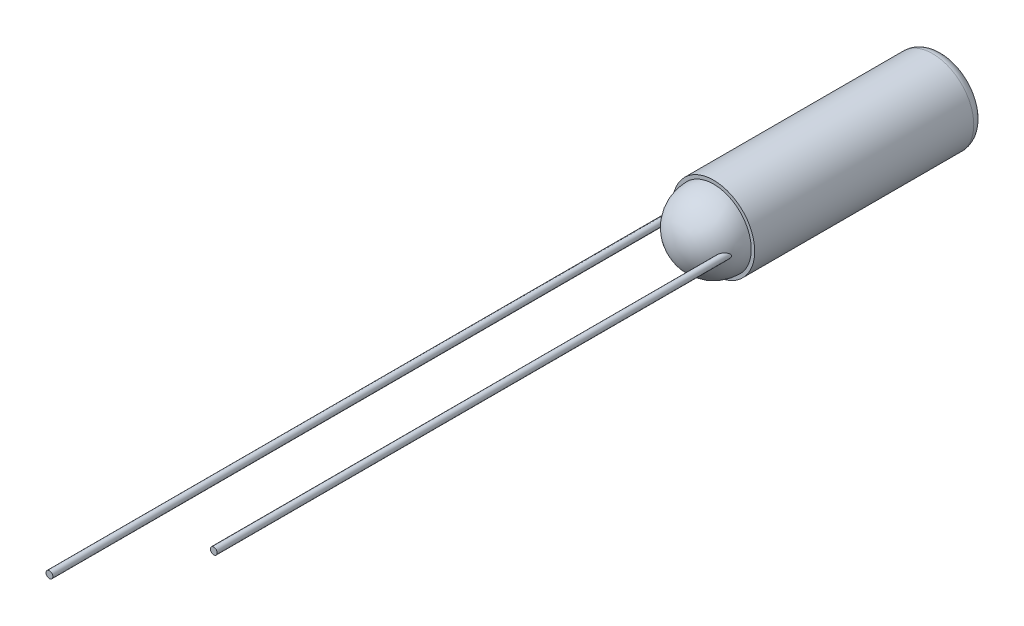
ISO-10303-21;
HEADER;
FILE_DESCRIPTION(('STEP AP214'),'2;1');
FILE_NAME('part.step','',(''),(''),'','','');
FILE_SCHEMA(('AUTOMOTIVE_DESIGN { 1 0 10303 214 1 1 1 1 }'));
ENDSEC;
DATA;
#1=APPLICATION_CONTEXT('core data for automotive mechanical design processes');
#2=APPLICATION_PROTOCOL_DEFINITION('international standard','automotive_design',2000,#1);
#3=PRODUCT_CONTEXT('',#1,'mechanical');
#4=PRODUCT('Part','Part','',(#3));
#5=PRODUCT_RELATED_PRODUCT_CATEGORY('part','',(#4));
#6=PRODUCT_DEFINITION_FORMATION('','',#4);
#7=PRODUCT_DEFINITION_CONTEXT('part definition',#1,'design');
#8=PRODUCT_DEFINITION('design','',#6,#7);
#9=PRODUCT_DEFINITION_SHAPE('','',#8);
#10=(LENGTH_UNIT() NAMED_UNIT(*) SI_UNIT(.MILLI.,.METRE.));
#11=(NAMED_UNIT(*) PLANE_ANGLE_UNIT() SI_UNIT($,.RADIAN.));
#12=(NAMED_UNIT(*) SI_UNIT($,.STERADIAN.) SOLID_ANGLE_UNIT());
#13=UNCERTAINTY_MEASURE_WITH_UNIT(LENGTH_MEASURE(1.E-05),#10,'distance_accuracy_value','');
#14=(GEOMETRIC_REPRESENTATION_CONTEXT(3) GLOBAL_UNCERTAINTY_ASSIGNED_CONTEXT((#13)) GLOBAL_UNIT_ASSIGNED_CONTEXT((#10,
#11,#12)) REPRESENTATION_CONTEXT('',''));
#15=CARTESIAN_POINT('',(0.,0.,0.));
#16=DIRECTION('',(0.,0.,1.));
#17=DIRECTION('',(1.,0.,0.));
#18=AXIS2_PLACEMENT_3D('',#15,#16,#17);
#19=CARTESIAN_POINT('',(-24.8104901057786,21.2733851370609,3.92921669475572));
#20=DIRECTION('',(0.,0.,-1.));
#21=DIRECTION('',(-1.,0.,0.));
#22=AXIS2_PLACEMENT_3D('',#19,#20,#21);
#23=PLANE('',#22);
#24=CARTESIAN_POINT('',(-24.8104901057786,19.7493851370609,3.9292166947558));
#25=DIRECTION('',(0.,0.,-1.));
#26=DIRECTION('',(-1.,0.,0.));
#27=AXIS2_PLACEMENT_3D('',#24,#25,#26);
#28=CIRCLE('',#27,1.396990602);
#29=CARTESIAN_POINT('',(-26.2074807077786,19.7493851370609,3.92921669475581));
#30=VERTEX_POINT('',#29);
#31=EDGE_CURVE('E69',#30,#30,#28,.T.);
#32=ORIENTED_EDGE('',*,*,#31,.T.);
#33=EDGE_LOOP('',(#32));
#34=FACE_BOUND('',#33,.T.);
#35=CARTESIAN_POINT('',(-24.8104901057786,19.7493851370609,3.92921669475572));
#36=DIRECTION('',(0.,0.,1.));
#37=DIRECTION('',(1.,0.,0.));
#38=AXIS2_PLACEMENT_3D('',#35,#36,#37);
#39=CIRCLE('',#38,1.524);
#40=CARTESIAN_POINT('',(-23.2864901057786,19.7493851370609,3.92921669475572));
#41=VERTEX_POINT('',#40);
#42=EDGE_CURVE('E58',#41,#41,#39,.T.);
#43=ORIENTED_EDGE('',*,*,#42,.T.);
#44=EDGE_LOOP('',(#43));
#45=FACE_BOUND('',#44,.T.);
#46=ADVANCED_FACE('F16',(#34,#45),#23,.F.);
#47=CARTESIAN_POINT('',(-24.8104901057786,19.7493851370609,6.75193867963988));
#48=DIRECTION('',(0.,0.,1.));
#49=DIRECTION('',(1.,0.,0.));
#50=AXIS2_PLACEMENT_3D('',#47,#48,#49);
#51=CYLINDRICAL_SURFACE('',#50,1.524);
#52=ORIENTED_EDGE('',*,*,#42,.F.);
#53=EDGE_LOOP('',(#52));
#54=FACE_BOUND('',#53,.T.);
#55=CARTESIAN_POINT('',(-24.8104901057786,19.7493851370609,-4.19878330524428));
#56=DIRECTION('',(0.,0.,1.));
#57=DIRECTION('',(1.,0.,0.));
#58=AXIS2_PLACEMENT_3D('',#55,#56,#57);
#59=CIRCLE('',#58,1.524);
#60=CARTESIAN_POINT('',(-23.2864901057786,19.7493851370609,-4.19878330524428));
#61=VERTEX_POINT('',#60);
#62=EDGE_CURVE('E52',#61,#61,#59,.T.);
#63=ORIENTED_EDGE('',*,*,#62,.T.);
#64=EDGE_LOOP('',(#63));
#65=FACE_BOUND('',#64,.T.);
#66=ADVANCED_FACE('F87',(#54,#65),#51,.T.);
#67=CARTESIAN_POINT('',(-24.8104901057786,19.7493851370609,-4.19878330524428));
#68=DIRECTION('',(0.,0.,1.));
#69=DIRECTION('',(1.,0.,0.));
#70=AXIS2_PLACEMENT_3D('',#67,#68,#69);
#71=TOROIDAL_SURFACE('',#70,1.143,0.381000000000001);
#72=ORIENTED_EDGE('',*,*,#62,.F.);
#73=EDGE_LOOP('',(#72));
#74=FACE_BOUND('',#73,.T.);
#75=CARTESIAN_POINT('',(-24.8104901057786,19.7493851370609,-4.57978330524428));
#76=DIRECTION('',(0.,0.,1.));
#77=DIRECTION('',(1.,0.,0.));
#78=AXIS2_PLACEMENT_3D('',#75,#76,#77);
#79=CIRCLE('',#78,1.14300000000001);
#80=CARTESIAN_POINT('',(-23.6674901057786,19.7493851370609,-4.57978330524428));
#81=VERTEX_POINT('',#80);
#82=EDGE_CURVE('E47',#81,#81,#79,.T.);
#83=ORIENTED_EDGE('',*,*,#82,.T.);
#84=EDGE_LOOP('',(#83));
#85=FACE_BOUND('',#84,.T.);
#86=ADVANCED_FACE('F83',(#74,#85),#71,.T.);
#87=CARTESIAN_POINT('',(-24.8104901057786,20.8923851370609,-4.57978330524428));
#88=DIRECTION('',(0.,0.,1.));
#89=DIRECTION('',(1.,0.,0.));
#90=AXIS2_PLACEMENT_3D('',#87,#88,#89);
#91=PLANE('',#90);
#92=ORIENTED_EDGE('',*,*,#82,.F.);
#93=EDGE_LOOP('',(#92));
#94=FACE_BOUND('',#93,.T.);
#95=ADVANCED_FACE('F80',(#94),#91,.F.);
#96=CARTESIAN_POINT('',(-24.8104901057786,19.7493851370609,3.9292166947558));
#97=DIRECTION('',(0.,0.,-1.));
#98=DIRECTION('',(-1.,0.,0.));
#99=AXIS2_PLACEMENT_3D('',#96,#97,#98);
#100=SPHERICAL_SURFACE('',#99,1.396990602);
#101=CARTESIAN_POINT('',(-26.0704996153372,19.705387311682,4.53090014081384));
#102=CARTESIAN_POINT('',(-26.0655741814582,19.6969257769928,4.54059567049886));
#103=CARTESIAN_POINT('',(-26.060089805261,19.6897045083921,4.55107731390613));
#104=CARTESIAN_POINT('',(-26.0484034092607,19.6770024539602,4.57272927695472));
#105=CARTESIAN_POINT('',(-26.0421962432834,19.6715353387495,4.58390423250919));
#106=CARTESIAN_POINT('',(-26.0252237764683,19.6591197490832,4.61358611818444));
#107=CARTESIAN_POINT('',(-26.0140189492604,19.6533552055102,4.63234221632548));
#108=CARTESIAN_POINT('',(-25.99058893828,19.64525543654,4.66990078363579));
#109=CARTESIAN_POINT('',(-25.9783650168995,19.6429160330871,4.68870316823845));
#110=CARTESIAN_POINT('',(-25.9559938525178,19.6420327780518,4.72179824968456));
#111=CARTESIAN_POINT('',(-25.9459871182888,19.6427623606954,4.7361664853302));
#112=CARTESIAN_POINT('',(-25.9257721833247,19.646801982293,4.76438667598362));
#113=CARTESIAN_POINT('',(-25.9155645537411,19.6501055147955,4.77823984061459));
#114=CARTESIAN_POINT('',(-25.8995567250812,19.6578509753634,4.79941366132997));
#115=CARTESIAN_POINT('',(-25.8936841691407,19.6612527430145,4.80706101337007));
#116=CARTESIAN_POINT('',(-25.8821608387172,19.6693210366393,4.82185214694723));
#117=CARTESIAN_POINT('',(-25.8765098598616,19.6739863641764,4.82899639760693));
#118=CARTESIAN_POINT('',(-25.8670767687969,19.6833922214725,4.84075920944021));
#119=CARTESIAN_POINT('',(-25.8631883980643,19.6878033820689,4.84555411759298));
#120=CARTESIAN_POINT('',(-25.8558344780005,19.6975184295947,4.85452999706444));
#121=CARTESIAN_POINT('',(-25.8523681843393,19.7028207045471,4.85871205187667));
#122=CARTESIAN_POINT('',(-25.8469375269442,19.7127944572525,4.86519270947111));
#123=CARTESIAN_POINT('',(-25.844820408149,19.7172492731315,4.86769489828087));
#124=CARTESIAN_POINT('',(-25.8410493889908,19.7266286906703,4.87210735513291));
#125=CARTESIAN_POINT('',(-25.8393952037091,19.73155300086,4.87401798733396));
#126=CARTESIAN_POINT('',(-25.8366595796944,19.7418375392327,4.87712651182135));
#127=CARTESIAN_POINT('',(-25.8355841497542,19.747201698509,4.87831694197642));
#128=CARTESIAN_POINT('',(-25.8341384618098,19.7581424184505,4.87983809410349));
#129=CARTESIAN_POINT('',(-25.8337674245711,19.7637187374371,4.88016976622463));
#130=CARTESIAN_POINT('',(-25.8337637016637,19.7740061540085,4.87995853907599));
#131=CARTESIAN_POINT('',(-25.8340278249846,19.778720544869,4.87954033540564));
#132=CARTESIAN_POINT('',(-25.8350596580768,19.7879975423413,4.87809569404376));
#133=CARTESIAN_POINT('',(-25.8358274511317,19.7925601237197,4.87706915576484));
#134=CARTESIAN_POINT('',(-25.837803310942,19.8014115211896,4.87448160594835));
#135=CARTESIAN_POINT('',(-25.8390100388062,19.8057011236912,4.87292222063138));
#136=CARTESIAN_POINT('',(-25.8417892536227,19.8139596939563,4.86935346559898));
#137=CARTESIAN_POINT('',(-25.8433618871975,19.8179285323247,4.86734391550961));
#138=CARTESIAN_POINT('',(-25.8477919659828,19.8277080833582,4.8616908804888));
#139=CARTESIAN_POINT('',(-25.8508675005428,19.8332619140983,4.85777322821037));
#140=CARTESIAN_POINT('',(-25.8575093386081,19.843513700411,4.84928678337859));
#141=CARTESIAN_POINT('',(-25.861076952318,19.8482092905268,4.84471625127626));
#142=CARTESIAN_POINT('',(-25.8704954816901,19.8590752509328,4.83258173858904));
#143=CARTESIAN_POINT('',(-25.8765580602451,19.8647168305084,4.82471057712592));
#144=CARTESIAN_POINT('',(-25.8890357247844,19.8744218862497,4.80831758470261));
#145=CARTESIAN_POINT('',(-25.8954514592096,19.8784823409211,4.79979454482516));
#146=CARTESIAN_POINT('',(-25.9121932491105,19.887235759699,4.77724630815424));
#147=CARTESIAN_POINT('',(-25.9226212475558,19.8909206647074,4.76290668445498));
#148=CARTESIAN_POINT('',(-25.9433372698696,19.8955657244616,4.73370338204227));
#149=CARTESIAN_POINT('',(-25.9536249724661,19.8965204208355,4.71883871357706));
#150=CARTESIAN_POINT('',(-25.9743250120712,19.8960392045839,4.68811335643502));
#151=CARTESIAN_POINT('',(-25.9847163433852,19.8944772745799,4.67224087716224));
#152=CARTESIAN_POINT('',(-26.004847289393,19.8888822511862,4.64054890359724));
#153=CARTESIAN_POINT('',(-26.0145880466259,19.8848536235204,4.62472936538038));
#154=CARTESIAN_POINT('',(-26.0295815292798,19.8762585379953,4.59961605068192));
#155=CARTESIAN_POINT('',(-26.0350982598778,19.8725202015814,4.59019226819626));
#156=CARTESIAN_POINT('',(-26.0457663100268,19.8639299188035,4.57162448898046));
#157=CARTESIAN_POINT('',(-26.0509174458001,19.8590774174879,4.56248063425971));
#158=CARTESIAN_POINT('',(-26.0595105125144,19.8493781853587,4.54696074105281));
#159=CARTESIAN_POINT('',(-26.0630598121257,19.8448276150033,4.54046003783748));
#160=CARTESIAN_POINT('',(-26.0697732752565,19.8347641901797,4.52802693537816));
#161=CARTESIAN_POINT('',(-26.0729386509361,19.8292545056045,4.52209276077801));
#162=CARTESIAN_POINT('',(-26.0772610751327,19.8200102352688,4.51394367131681));
#163=CARTESIAN_POINT('',(-26.0786412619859,19.8167318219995,4.51133290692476));
#164=CARTESIAN_POINT('',(-26.0811924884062,19.8098157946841,4.50650836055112));
#165=CARTESIAN_POINT('',(-26.0823637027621,19.8061784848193,4.50429424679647));
#166=CARTESIAN_POINT('',(-26.084247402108,19.7991858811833,4.50075702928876));
#167=CARTESIAN_POINT('',(-26.0850040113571,19.7958875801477,4.49934646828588));
#168=CARTESIAN_POINT('',(-26.0862676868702,19.7890720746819,4.49703054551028));
#169=CARTESIAN_POINT('',(-26.0867750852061,19.7855551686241,4.49612451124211));
#170=CARTESIAN_POINT('',(-26.087495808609,19.778352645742,4.49491417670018));
#171=CARTESIAN_POINT('',(-26.08770641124,19.7746657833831,4.49461543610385));
#172=CARTESIAN_POINT('',(-26.0878027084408,19.7672938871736,4.49467944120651));
#173=CARTESIAN_POINT('',(-26.0876884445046,19.7636088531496,4.495042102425));
#174=CARTESIAN_POINT('',(-26.0871924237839,19.7568662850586,4.49628649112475));
#175=CARTESIAN_POINT('',(-26.0868487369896,19.7537910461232,4.49709179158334));
#176=CARTESIAN_POINT('',(-26.0859653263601,19.7477988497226,4.49908805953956));
#177=CARTESIAN_POINT('',(-26.0854254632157,19.7448820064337,4.50027930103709));
#178=CARTESIAN_POINT('',(-26.0837813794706,19.7374011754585,4.50384358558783));
#179=CARTESIAN_POINT('',(-26.0825381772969,19.7329951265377,4.50648214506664));
#180=CARTESIAN_POINT('',(-26.0797423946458,19.7246787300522,4.5123109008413));
#181=CARTESIAN_POINT('',(-26.0781890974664,19.720769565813,4.51550237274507));
#182=CARTESIAN_POINT('',(-26.0746454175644,19.712919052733,4.52268081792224));
#183=CARTESIAN_POINT('',(-26.0726245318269,19.7090377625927,4.52671732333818));
#184=CARTESIAN_POINT('',(-26.0704996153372,19.705387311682,4.53090014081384));
#185=B_SPLINE_CURVE_WITH_KNOTS('',3,(#101,#102,#103,#104,#105,#106,#107,#108,#109,#110,#111,
#112,#113,#114,#115,#116,#117,#118,#119,#120,#121,#122,#123,#124,#125,#126,#127,#128,#129,#130,
#131,#132,#133,#134,#135,#136,#137,#138,#139,#140,#141,#142,#143,#144,#145,#146,#147,#148,#149,
#150,#151,#152,#153,#154,#155,#156,#157,#158,#159,#160,#161,#162,#163,#164,#165,#166,#167,#168,
#169,#170,#171,#172,#173,#174,#175,#176,#177,#178,#179,#180,#181,#182,#183,#184),.UNSPECIFIED.,
.T.,.F.,(4,2,2,2,2,2,2,2,2,2,2,2,2,2,2,2,2,2,2,2,2,2,2,2,2,2,2,2,2,2,2,2,2,2,2,2,2,2,2,2,2,4),
(0.,0.0413100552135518,0.0829346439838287,0.150372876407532,0.217728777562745,0.270150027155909,
0.32243919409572,0.353044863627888,0.383621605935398,0.406316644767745,0.428971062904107,
0.445504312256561,0.462027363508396,0.478718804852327,0.495391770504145,0.509542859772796,
0.523696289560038,0.537806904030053,0.551923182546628,0.574175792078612,0.596488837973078,
0.630573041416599,0.664722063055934,0.718752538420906,0.772890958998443,0.829825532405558,
0.886657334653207,0.921238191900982,0.955836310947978,0.981866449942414,1.0078121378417,
1.02102230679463,1.03422137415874,1.04517912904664,1.05612224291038,1.06716509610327,
1.07820653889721,1.08776197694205,1.09732421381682,1.11308499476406,1.12888263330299,
1.14670449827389),.UNSPECIFIED.);
#186=CARTESIAN_POINT('',(-26.0704996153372,19.705387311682,4.53090014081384));
#187=VERTEX_POINT('',#186);
#188=EDGE_CURVE('E20',#187,#187,#185,.T.);
#189=ORIENTED_EDGE('',*,*,#188,.F.);
#190=EDGE_LOOP('',(#189));
#191=FACE_BOUND('',#190,.T.);
#192=CARTESIAN_POINT('',(-23.5556650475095,19.7252789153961,4.54274396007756));
#193=CARTESIAN_POINT('',(-23.5587826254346,19.7168443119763,4.54878869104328));
#194=CARTESIAN_POINT('',(-23.5625380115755,19.7093954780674,4.55588717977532));
#195=CARTESIAN_POINT('',(-23.5707788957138,19.6960107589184,4.57106718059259));
#196=CARTESIAN_POINT('',(-23.5752721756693,19.6900929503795,4.57915890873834));
#197=CARTESIAN_POINT('',(-23.5873800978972,19.6765179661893,4.6004575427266));
#198=CARTESIAN_POINT('',(-23.5953433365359,19.6697175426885,4.61401150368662));
#199=CARTESIAN_POINT('',(-23.6120491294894,19.6584422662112,4.64149641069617));
#200=CARTESIAN_POINT('',(-23.620789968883,19.6539624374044,4.65542648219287));
#201=CARTESIAN_POINT('',(-23.6397121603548,19.6468039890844,4.68465156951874));
#202=CARTESIAN_POINT('',(-23.6499524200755,19.6443225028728,4.69995714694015));
#203=CARTESIAN_POINT('',(-23.6709805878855,19.6419370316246,4.73040277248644));
#204=CARTESIAN_POINT('',(-23.6817683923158,19.6420325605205,4.74554285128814));
#205=CARTESIAN_POINT('',(-23.7009078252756,19.6447596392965,4.77162872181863));
#206=CARTESIAN_POINT('',(-23.7092005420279,19.6467567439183,4.78268398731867));
#207=CARTESIAN_POINT('',(-23.7257568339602,19.6526665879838,4.80430253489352));
#208=CARTESIAN_POINT('',(-23.7340204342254,19.6565764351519,4.81486653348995));
#209=CARTESIAN_POINT('',(-23.7475592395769,19.6650413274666,4.8318435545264));
#210=CARTESIAN_POINT('',(-23.752931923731,19.668972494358,4.83848878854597));
#211=CARTESIAN_POINT('',(-23.7633453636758,19.6780322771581,4.851207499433));
#212=CARTESIAN_POINT('',(-23.768386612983,19.6831590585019,4.85728183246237));
#213=CARTESIAN_POINT('',(-23.77648634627,19.6930714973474,4.86692244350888));
#214=CARTESIAN_POINT('',(-23.7796951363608,19.6975228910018,4.87070442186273));
#215=CARTESIAN_POINT('',(-23.7856640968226,19.7071385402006,4.8776752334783));
#216=CARTESIAN_POINT('',(-23.788424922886,19.7123017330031,4.88086493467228));
#217=CARTESIAN_POINT('',(-23.7927939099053,19.7221477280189,4.88585807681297));
#218=CARTESIAN_POINT('',(-23.7945223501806,19.7267000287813,4.88781205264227));
#219=CARTESIAN_POINT('',(-23.7974823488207,19.7361731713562,4.89111625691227));
#220=CARTESIAN_POINT('',(-23.7987142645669,19.7410937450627,4.89246691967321));
#221=CARTESIAN_POINT('',(-23.8005943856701,19.7512235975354,4.89447196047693));
#222=CARTESIAN_POINT('',(-23.8012384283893,19.7564346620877,4.89512137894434));
#223=CARTESIAN_POINT('',(-23.8018705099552,19.7669347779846,4.89564774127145));
#224=CARTESIAN_POINT('',(-23.8018588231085,19.7722237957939,4.89552500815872));
#225=CARTESIAN_POINT('',(-23.8012252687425,19.7821045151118,4.89457601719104));
#226=CARTESIAN_POINT('',(-23.8006709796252,19.7867086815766,4.89382901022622));
#227=CARTESIAN_POINT('',(-23.7990963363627,19.7957094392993,4.89178689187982));
#228=CARTESIAN_POINT('',(-23.7980758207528,19.8001059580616,4.89049159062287));
#229=CARTESIAN_POINT('',(-23.7952655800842,19.8098960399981,4.88696272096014));
#230=CARTESIAN_POINT('',(-23.7933366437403,19.8151898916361,4.88456394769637));
#231=CARTESIAN_POINT('',(-23.7889584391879,19.8252063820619,4.87913477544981));
#232=CARTESIAN_POINT('',(-23.7865082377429,19.8299279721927,4.8761032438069));
#233=CARTESIAN_POINT('',(-23.7801234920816,19.840637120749,4.86819234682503));
#234=CARTESIAN_POINT('',(-23.7759965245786,19.8463292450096,4.86307017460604));
#235=CARTESIAN_POINT('',(-23.7672713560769,19.8566171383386,4.85217622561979));
#236=CARTESIAN_POINT('',(-23.7626722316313,19.8612106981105,4.84640317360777));
#237=CARTESIAN_POINT('',(-23.7505946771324,19.8716736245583,4.83112025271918));
#238=CARTESIAN_POINT('',(-23.7429213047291,19.8768595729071,4.82129841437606));
#239=CARTESIAN_POINT('',(-23.727337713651,19.8852751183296,4.80104214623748));
#240=CARTESIAN_POINT('',(-23.719427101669,19.8885012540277,4.79060666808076));
#241=CARTESIAN_POINT('',(-23.6997326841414,19.8944534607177,4.76417564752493));
#242=CARTESIAN_POINT('',(-23.6879448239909,19.8961651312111,4.74795458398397));
#243=CARTESIAN_POINT('',(-23.6647818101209,19.896455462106,4.71516216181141));
#244=CARTESIAN_POINT('',(-23.6534078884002,19.8950254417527,4.69858995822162));
#245=CARTESIAN_POINT('',(-23.6310594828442,19.8891304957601,4.66503249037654));
#246=CARTESIAN_POINT('',(-23.6201053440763,19.8845810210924,4.64804877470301));
#247=CARTESIAN_POINT('',(-23.5992332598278,19.8721330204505,4.61463302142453));
#248=CARTESIAN_POINT('',(-23.5893125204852,19.8642438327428,4.59819958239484));
#249=CARTESIAN_POINT('',(-23.5761079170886,19.8495037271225,4.57570570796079));
#250=CARTESIAN_POINT('',(-23.5721551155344,19.8444328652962,4.56887574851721));
#251=CARTESIAN_POINT('',(-23.564762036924,19.8331154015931,4.5559699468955));
#252=CARTESIAN_POINT('',(-23.5613186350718,19.8268765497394,4.54988954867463));
#253=CARTESIAN_POINT('',(-23.5569416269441,19.8167907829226,4.54213817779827));
#254=CARTESIAN_POINT('',(-23.5556747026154,19.8135344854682,4.53989104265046));
#255=CARTESIAN_POINT('',(-23.553357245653,19.8067036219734,4.53579024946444));
#256=CARTESIAN_POINT('',(-23.5523067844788,19.8031289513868,4.53393672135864));
#257=CARTESIAN_POINT('',(-23.5504782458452,19.7956275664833,4.53074156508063));
#258=CARTESIAN_POINT('',(-23.5497038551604,19.7916969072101,4.52940684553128));
#259=CARTESIAN_POINT('',(-23.5485253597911,19.7836122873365,4.52744223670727));
#260=CARTESIAN_POINT('',(-23.5481203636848,19.7794588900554,4.52681064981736));
#261=CARTESIAN_POINT('',(-23.5477505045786,19.7715828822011,4.5263702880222));
#262=CARTESIAN_POINT('',(-23.5477393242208,19.7678673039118,4.52647317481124));
#263=CARTESIAN_POINT('',(-23.5480363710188,19.7605132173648,4.52728291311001));
#264=CARTESIAN_POINT('',(-23.5483450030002,19.7568748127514,4.52799052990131));
#265=CARTESIAN_POINT('',(-23.5493165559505,19.7492189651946,4.53008474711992));
#266=CARTESIAN_POINT('',(-23.5500279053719,19.7452329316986,4.53156123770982));
#267=CARTESIAN_POINT('',(-23.5517513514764,19.7375813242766,4.53505381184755));
#268=CARTESIAN_POINT('',(-23.5527635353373,19.7339158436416,4.53707005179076));
#269=CARTESIAN_POINT('',(-23.5541717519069,19.7295396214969,4.53983461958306));
#270=CARTESIAN_POINT('',(-23.554461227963,19.7286727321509,4.54040107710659));
#271=CARTESIAN_POINT('',(-23.5550534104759,19.7269603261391,4.54155624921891));
#272=CARTESIAN_POINT('',(-23.5553560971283,19.72611478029,4.54214493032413));
#273=CARTESIAN_POINT('',(-23.5556650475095,19.7252789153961,4.54274396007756));
#274=B_SPLINE_CURVE_WITH_KNOTS('',3,(#192,#193,#194,#195,#196,#197,#198,#199,#200,#201,#202,
#203,#204,#205,#206,#207,#208,#209,#210,#211,#212,#213,#214,#215,#216,#217,#218,#219,#220,#221,
#222,#223,#224,#225,#226,#227,#228,#229,#230,#231,#232,#233,#234,#235,#236,#237,#238,#239,#240,
#241,#242,#243,#244,#245,#246,#247,#248,#249,#250,#251,#252,#253,#254,#255,#256,#257,#258,#259,
#260,#261,#262,#263,#264,#265,#266,#267,#268,#269,#270,#271,#272,#273),.UNSPECIFIED.,.T.,.F.,(4,
2,2,2,2,2,2,2,2,2,2,2,2,2,2,2,2,2,2,2,2,2,2,2,2,2,2,2,2,2,2,2,2,2,2,2,2,2,2,2,4),(0.,
0.0325024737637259,0.0653727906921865,0.11648114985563,0.167479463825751,0.223042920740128,
0.27859589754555,0.320379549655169,0.362100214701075,0.39024581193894,0.418348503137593,
0.43827980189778,0.458181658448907,0.473860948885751,0.489528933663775,0.50530701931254,
0.521078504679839,0.53510696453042,0.549140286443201,0.567410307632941,0.585713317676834,
0.611664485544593,0.637667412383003,0.677941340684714,0.718286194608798,0.778342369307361,
0.838564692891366,0.900487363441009,0.962238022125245,0.990313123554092,1.01820814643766,
1.03064348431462,1.04308292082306,1.05568275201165,1.06825209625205,1.07933749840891,
1.09043694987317,1.10329684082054,1.11616046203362,1.11938612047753,1.12260709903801),.UNSPECIFIED.);
#275=CARTESIAN_POINT('',(-23.5556650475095,19.7252789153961,4.54274396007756));
#276=VERTEX_POINT('',#275);
#277=EDGE_CURVE('E62',#276,#276,#274,.T.);
#278=ORIENTED_EDGE('',*,*,#277,.T.);
#279=EDGE_LOOP('',(#278));
#280=FACE_BOUND('',#279,.T.);
#281=ORIENTED_EDGE('',*,*,#31,.F.);
#282=EDGE_LOOP('',(#281));
#283=FACE_BOUND('',#282,.T.);
#284=ADVANCED_FACE('F70',(#191,#280,#283),#100,.T.);
#285=CARTESIAN_POINT('',(-23.6747842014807,19.7693201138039,23.6142166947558));
#286=DIRECTION('',(0.,0.,-1.));
#287=DIRECTION('',(0.,1.,0.));
#288=AXIS2_PLACEMENT_3D('',#285,#286,#287);
#289=PLANE('',#288);
#290=CARTESIAN_POINT('',(-23.6747842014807,19.7693201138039,23.6142166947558));
#291=DIRECTION('',(0.,0.,-1.));
#292=DIRECTION('',(0.,1.,0.));
#293=AXIS2_PLACEMENT_3D('',#290,#291,#292);
#294=CIRCLE('',#293,0.126999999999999);
#295=CARTESIAN_POINT('',(-23.6747842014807,19.8963201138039,23.6142166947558));
#296=VERTEX_POINT('',#295);
#297=EDGE_CURVE('E44',#296,#296,#294,.T.);
#298=ORIENTED_EDGE('',*,*,#297,.F.);
#299=EDGE_LOOP('',(#298));
#300=FACE_BOUND('',#299,.T.);
#301=ADVANCED_FACE('F45',(#300),#289,.F.);
#302=CARTESIAN_POINT('',(-23.6747842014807,19.7693201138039,23.6142166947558));
#303=DIRECTION('',(0.,0.,-1.));
#304=DIRECTION('',(0.,-1.,0.));
#305=AXIS2_PLACEMENT_3D('',#302,#303,#304);
#306=CYLINDRICAL_SURFACE('',#305,0.126999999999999);
#307=ORIENTED_EDGE('',*,*,#297,.T.);
#308=EDGE_LOOP('',(#307));
#309=FACE_BOUND('',#308,.T.);
#310=ORIENTED_EDGE('',*,*,#277,.F.);
#311=EDGE_LOOP('',(#310));
#312=FACE_BOUND('',#311,.T.);
#313=ADVANCED_FACE('F73',(#309,#312),#306,.T.);
#314=CARTESIAN_POINT('',(-25.9607654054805,19.7693201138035,27.4242166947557));
#315=DIRECTION('',(0.,0.,-1.));
#316=DIRECTION('',(0.,1.,0.));
#317=AXIS2_PLACEMENT_3D('',#314,#315,#316);
#318=CYLINDRICAL_SURFACE('',#317,0.126999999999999);
#319=CARTESIAN_POINT('',(-25.9607654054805,19.7693201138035,27.4242166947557));
#320=DIRECTION('',(0.,0.,-1.));
#321=DIRECTION('',(0.,-1.,0.));
#322=AXIS2_PLACEMENT_3D('',#319,#320,#321);
#323=CIRCLE('',#322,0.126999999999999);
#324=CARTESIAN_POINT('',(-25.9607654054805,19.6423201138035,27.4242166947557));
#325=VERTEX_POINT('',#324);
#326=EDGE_CURVE('E10',#325,#325,#323,.T.);
#327=ORIENTED_EDGE('',*,*,#326,.T.);
#328=EDGE_LOOP('',(#327));
#329=FACE_BOUND('',#328,.T.);
#330=ORIENTED_EDGE('',*,*,#188,.T.);
#331=EDGE_LOOP('',(#330));
#332=FACE_BOUND('',#331,.T.);
#333=ADVANCED_FACE('F77',(#329,#332),#318,.T.);
#334=CARTESIAN_POINT('',(-25.9607654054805,19.7693201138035,27.4242166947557));
#335=DIRECTION('',(0.,0.,-1.));
#336=DIRECTION('',(0.,-1.,0.));
#337=AXIS2_PLACEMENT_3D('',#334,#335,#336);
#338=PLANE('',#337);
#339=ORIENTED_EDGE('',*,*,#326,.F.);
#340=EDGE_LOOP('',(#339));
#341=FACE_BOUND('',#340,.T.);
#342=ADVANCED_FACE('F18',(#341),#338,.F.);
#343=CLOSED_SHELL('',(#46,#66,#86,#95,#284,#301,#313,#333,#342));
#344=MANIFOLD_SOLID_BREP('B1',#343);
#345=ADVANCED_BREP_SHAPE_REPRESENTATION('',(#18,#344),#14);
#346=SHAPE_DEFINITION_REPRESENTATION(#9,#345);
ENDSEC;
END-ISO-10303-21;
